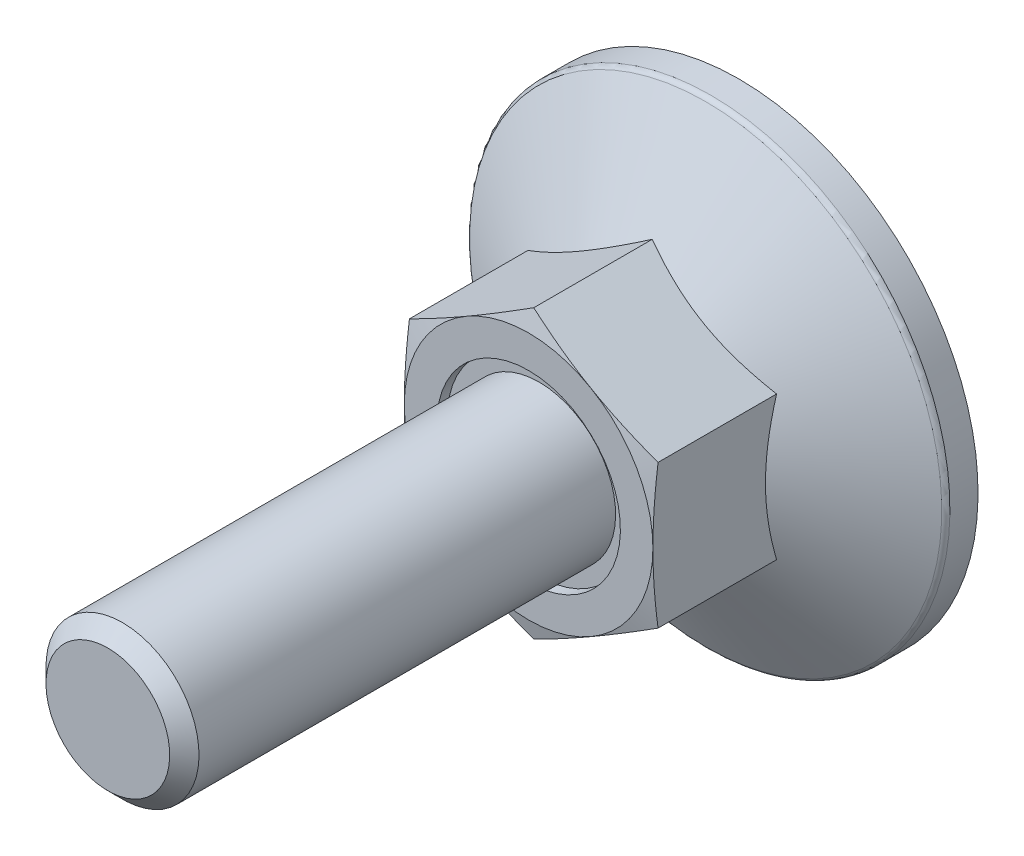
ISO-10303-21;
HEADER;
FILE_DESCRIPTION(('STEP AP214'),'2;1');
FILE_NAME('part.step','',(''),(''),'','','');
FILE_SCHEMA(('AUTOMOTIVE_DESIGN { 1 0 10303 214 1 1 1 1 }'));
ENDSEC;
DATA;
#1=APPLICATION_CONTEXT('core data for automotive mechanical design processes');
#2=APPLICATION_PROTOCOL_DEFINITION('international standard','automotive_design',2000,#1);
#3=PRODUCT_CONTEXT('',#1,'mechanical');
#4=PRODUCT('Part','Part','',(#3));
#5=PRODUCT_RELATED_PRODUCT_CATEGORY('part','',(#4));
#6=PRODUCT_DEFINITION_FORMATION('','',#4);
#7=PRODUCT_DEFINITION_CONTEXT('part definition',#1,'design');
#8=PRODUCT_DEFINITION('design','',#6,#7);
#9=PRODUCT_DEFINITION_SHAPE('','',#8);
#10=(LENGTH_UNIT() NAMED_UNIT(*) SI_UNIT(.MILLI.,.METRE.));
#11=(NAMED_UNIT(*) PLANE_ANGLE_UNIT() SI_UNIT($,.RADIAN.));
#12=(NAMED_UNIT(*) SI_UNIT($,.STERADIAN.) SOLID_ANGLE_UNIT());
#13=UNCERTAINTY_MEASURE_WITH_UNIT(LENGTH_MEASURE(1.E-05),#10,'distance_accuracy_value','');
#14=(GEOMETRIC_REPRESENTATION_CONTEXT(3) GLOBAL_UNCERTAINTY_ASSIGNED_CONTEXT((#13)) GLOBAL_UNIT_ASSIGNED_CONTEXT((#10,
#11,#12)) REPRESENTATION_CONTEXT('',''));
#15=CARTESIAN_POINT('',(0.,0.,0.));
#16=DIRECTION('',(0.,0.,1.));
#17=DIRECTION('',(1.,0.,0.));
#18=AXIS2_PLACEMENT_3D('',#15,#16,#17);
#19=CARTESIAN_POINT('',(0.,0.,10.45));
#20=DIRECTION('',(0.,0.,-1.));
#21=DIRECTION('',(0.,1.,0.));
#22=AXIS2_PLACEMENT_3D('',#19,#20,#21);
#23=PLANE('',#22);
#24=CARTESIAN_POINT('',(0.,0.,10.45));
#25=DIRECTION('',(0.,0.,-1.));
#26=DIRECTION('',(0.,1.,0.));
#27=AXIS2_PLACEMENT_3D('',#24,#25,#26);
#28=CIRCLE('',#27,4.8);
#29=CARTESIAN_POINT('',(0.,4.8,10.45));
#30=VERTEX_POINT('',#29);
#31=EDGE_CURVE('E27',#30,#30,#28,.T.);
#32=ORIENTED_EDGE('',*,*,#31,.F.);
#33=EDGE_LOOP('',(#32));
#34=FACE_BOUND('',#33,.T.);
#35=CARTESIAN_POINT('',(0.,0.,10.45));
#36=DIRECTION('',(0.,0.,-1.));
#37=DIRECTION('',(0.,1.,0.));
#38=AXIS2_PLACEMENT_3D('',#35,#36,#37);
#39=CIRCLE('',#38,4.);
#40=CARTESIAN_POINT('',(0.,4.,10.45));
#41=VERTEX_POINT('',#40);
#42=EDGE_CURVE('E252',#41,#41,#39,.F.);
#43=ORIENTED_EDGE('',*,*,#42,.F.);
#44=EDGE_LOOP('',(#43));
#45=FACE_BOUND('',#44,.T.);
#46=ADVANCED_FACE('F14',(#34,#45),#23,.F.);
#47=CARTESIAN_POINT('',(0.,7.5055534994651,22.));
#48=DIRECTION('',(0.499999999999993,-0.866025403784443,0.));
#49=DIRECTION('',(0.866025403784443,0.499999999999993,0.));
#50=AXIS2_PLACEMENT_3D('',#47,#48,#49);
#51=PLANE('',#50);
#52=CARTESIAN_POINT('',(-6.5002,3.75266127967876,4.53347836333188));
#53=CARTESIAN_POINT('',(-6.35732254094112,3.83515161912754,4.58109719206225));
#54=CARTESIAN_POINT('',(-6.21391236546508,3.91794952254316,4.62655491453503));
#55=CARTESIAN_POINT('',(-5.9259273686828,4.08421773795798,4.71255293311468));
#56=CARTESIAN_POINT('',(-5.78135207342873,4.16768832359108,4.7530911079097));
#57=CARTESIAN_POINT('',(-5.34531134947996,4.41943655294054,4.86653061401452));
#58=CARTESIAN_POINT('',(-5.05212471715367,4.58870793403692,4.93105380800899));
#59=CARTESIAN_POINT('',(-4.61337625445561,4.84201947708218,5.00671503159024));
#60=CARTESIAN_POINT('',(-4.46912536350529,4.92530276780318,5.02826875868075));
#61=CARTESIAN_POINT('',(-4.17997178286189,5.09224566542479,5.06441130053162));
#62=CARTESIAN_POINT('',(-4.03506915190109,5.17590523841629,5.07900073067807));
#63=CARTESIAN_POINT('',(-3.74501222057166,5.34336968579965,5.10084286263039));
#64=CARTESIAN_POINT('',(-3.59985839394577,5.42717428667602,5.10810389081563));
#65=CARTESIAN_POINT('',(-3.30942466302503,5.59485627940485,5.11514131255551));
#66=CARTESIAN_POINT('',(-3.16414476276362,5.67873366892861,5.11491793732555));
#67=CARTESIAN_POINT('',(-2.76612405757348,5.90853103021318,5.1040181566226));
#68=CARTESIAN_POINT('',(-2.51351353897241,6.05437578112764,5.08571979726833));
#69=CARTESIAN_POINT('',(-2.00997032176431,6.34509659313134,5.02769527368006));
#70=CARTESIAN_POINT('',(-1.75903939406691,6.48997163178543,4.9879492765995));
#71=CARTESIAN_POINT('',(-1.25448277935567,6.78127752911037,4.8885957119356));
#72=CARTESIAN_POINT('',(-1.00092075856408,6.92767163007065,4.82856718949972));
#73=CARTESIAN_POINT('',(-0.497578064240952,7.21827667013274,4.69232662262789));
#74=CARTESIAN_POINT('',(-0.247790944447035,7.36249133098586,4.61614658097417));
#75=CARTESIAN_POINT('',(0.000200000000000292,7.50566896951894,4.53347836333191));
#76=B_SPLINE_CURVE_WITH_KNOTS('',3,(#52,#53,#54,#55,#56,#57,#58,#59,#60,#61,#62,#63,#64,#65,#66,
#67,#68,#69,#70,#71,#72,#73,#74,#75),.UNSPECIFIED.,.F.,.F.,(4,2,2,2,2,2,2,2,2,2,2,4),(0.,
0.515105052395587,1.03043143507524,2.06322554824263,2.56697389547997,3.07067772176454,
3.57380860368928,4.07692394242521,4.95279354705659,5.82947446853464,6.72559912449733,
7.61996451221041),.UNSPECIFIED.);
#77=CARTESIAN_POINT('',(-6.5,3.7527767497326,4.53354503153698));
#78=VERTEX_POINT('',#77);
#79=CARTESIAN_POINT('',(0.,7.5055534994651,4.53354503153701));
#80=VERTEX_POINT('',#79);
#81=EDGE_CURVE('E100',#78,#80,#76,.T.);
#82=ORIENTED_EDGE('',*,*,#81,.F.);
#83=DIRECTION('',(0.,0.,-1.));
#84=VECTOR('',#83,1.);
#85=CARTESIAN_POINT('',(-6.5,3.7527767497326,22.));
#86=LINE('',#85,#84);
#87=CARTESIAN_POINT('',(-6.5,3.7527767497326,10.7305627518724));
#88=VERTEX_POINT('',#87);
#89=EDGE_CURVE('E91',#88,#78,#86,.T.);
#90=ORIENTED_EDGE('',*,*,#89,.F.);
#91=CARTESIAN_POINT('',(0.000200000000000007,7.50566896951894,10.7305318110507));
#92=CARTESIAN_POINT('',(-0.269745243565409,7.34981601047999,10.7723102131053));
#93=CARTESIAN_POINT('',(-0.540179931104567,7.19368047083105,10.8102381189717));
#94=CARTESIAN_POINT('',(-1.08200437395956,6.8808579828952,10.876873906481));
#95=CARTESIAN_POINT('',(-1.35339447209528,6.72417083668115,10.9055780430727));
#96=CARTESIAN_POINT('',(-1.89548428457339,6.41119513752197,10.952090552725));
#97=CARTESIAN_POINT('',(-2.16618033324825,6.25490870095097,10.9699543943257));
#98=CARTESIAN_POINT('',(-2.70791763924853,5.94213652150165,10.9939079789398));
#99=CARTESIAN_POINT('',(-2.97895881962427,5.78565082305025,11.));
#100=CARTESIAN_POINT('',(-3.52104118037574,5.47267942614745,11.));
#101=CARTESIAN_POINT('',(-3.79208236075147,5.31619372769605,10.9939079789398));
#102=CARTESIAN_POINT('',(-4.33381966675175,5.00342154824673,10.9699543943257));
#103=CARTESIAN_POINT('',(-4.60451571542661,4.84713511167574,10.952090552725));
#104=CARTESIAN_POINT('',(-5.14660552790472,4.53415941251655,10.9055780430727));
#105=CARTESIAN_POINT('',(-5.41799562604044,4.3774722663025,10.876873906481));
#106=CARTESIAN_POINT('',(-5.95982006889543,4.06464977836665,10.8102381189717));
#107=CARTESIAN_POINT('',(-6.23025475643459,3.90851423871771,10.7723102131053));
#108=CARTESIAN_POINT('',(-6.5002,3.75266127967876,10.7305318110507));
#109=B_SPLINE_CURVE_WITH_KNOTS('',3,(#91,#92,#93,#94,#95,#96,#97,#98,#99,#100,#101,#102,#103,
#104,#105,#106,#107,#108),.UNSPECIFIED.,.F.,.F.,(4,2,2,2,2,2,2,2,4),(0.,0.943529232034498,
1.88744107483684,2.82648138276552,3.76533995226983,4.70419852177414,5.64323882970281,
6.58715067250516,7.53067990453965),.UNSPECIFIED.);
#110=CARTESIAN_POINT('',(-3.24999999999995,5.62916512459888,11.));
#111=VERTEX_POINT('',#110);
#112=EDGE_CURVE('E191',#111,#88,#109,.T.);
#113=ORIENTED_EDGE('',*,*,#112,.F.);
#114=CARTESIAN_POINT('',(0.,7.5055534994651,10.7305627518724));
#115=VERTEX_POINT('',#114);
#116=EDGE_CURVE('E478',#115,#111,#109,.T.);
#117=ORIENTED_EDGE('',*,*,#116,.F.);
#118=DIRECTION('',(0.,0.,-1.));
#119=VECTOR('',#118,1.);
#120=CARTESIAN_POINT('',(0.,7.5055534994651,22.));
#121=LINE('',#120,#119);
#122=EDGE_CURVE('E104',#115,#80,#121,.T.);
#123=ORIENTED_EDGE('',*,*,#122,.T.);
#124=EDGE_LOOP('',(#82,#90,#113,#117,#123));
#125=FACE_BOUND('',#124,.T.);
#126=ADVANCED_FACE('F103',(#125),#51,.F.);
#127=CARTESIAN_POINT('',(6.5,3.7527767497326,22.));
#128=DIRECTION('',(-0.499999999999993,-0.866025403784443,0.));
#129=DIRECTION('',(0.866025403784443,-0.499999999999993,0.));
#130=AXIS2_PLACEMENT_3D('',#127,#128,#129);
#131=PLANE('',#130);
#132=CARTESIAN_POINT('',(-0.0002,7.50566896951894,4.53347836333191));
#133=CARTESIAN_POINT('',(0.142677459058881,7.42317863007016,4.58109719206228));
#134=CARTESIAN_POINT('',(0.286087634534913,7.34038072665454,4.62655491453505));
#135=CARTESIAN_POINT('',(0.574072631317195,7.17411251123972,4.71255293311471));
#136=CARTESIAN_POINT('',(0.718647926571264,7.09064192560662,4.75309110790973));
#137=CARTESIAN_POINT('',(1.15468865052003,6.83889369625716,4.86653061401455));
#138=CARTESIAN_POINT('',(1.44787528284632,6.66962231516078,4.93105380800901));
#139=CARTESIAN_POINT('',(1.88662374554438,6.41631077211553,5.00671503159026));
#140=CARTESIAN_POINT('',(2.03087463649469,6.33302748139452,5.02826875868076));
#141=CARTESIAN_POINT('',(2.32002821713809,6.16608458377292,5.06441130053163));
#142=CARTESIAN_POINT('',(2.46493084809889,6.08242501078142,5.07900073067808));
#143=CARTESIAN_POINT('',(2.75498777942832,5.91496056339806,5.10084286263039));
#144=CARTESIAN_POINT('',(2.90014160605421,5.8311559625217,5.10810389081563));
#145=CARTESIAN_POINT('',(3.19057533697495,5.66347396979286,5.11514131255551));
#146=CARTESIAN_POINT('',(3.33585523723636,5.5795965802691,5.11491793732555));
#147=CARTESIAN_POINT('',(3.73387594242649,5.34979921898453,5.10401815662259));
#148=CARTESIAN_POINT('',(3.98648646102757,5.20395446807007,5.08571979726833));
#149=CARTESIAN_POINT('',(4.49002967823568,4.91323365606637,5.02769527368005));
#150=CARTESIAN_POINT('',(4.74096060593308,4.76835861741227,4.98794927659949));
#151=CARTESIAN_POINT('',(5.24551722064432,4.47705272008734,4.88859571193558));
#152=CARTESIAN_POINT('',(5.49907924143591,4.33065861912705,4.8285671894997));
#153=CARTESIAN_POINT('',(6.00242193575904,4.04005357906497,4.69232662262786));
#154=CARTESIAN_POINT('',(6.25220905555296,3.89583891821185,4.61614658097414));
#155=CARTESIAN_POINT('',(6.5002,3.75266127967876,4.53347836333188));
#156=B_SPLINE_CURVE_WITH_KNOTS('',3,(#132,#133,#134,#135,#136,#137,#138,#139,#140,#141,#142,
#143,#144,#145,#146,#147,#148,#149,#150,#151,#152,#153,#154,#155),.UNSPECIFIED.,.F.,.F.,(4,2,2,
2,2,2,2,2,2,2,2,4),(0.,0.515105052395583,1.03043143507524,2.06322554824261,2.56697389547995,
3.07067772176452,3.57380860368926,4.07692394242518,4.95279354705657,5.82947446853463,
6.72559912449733,7.61996451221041),.UNSPECIFIED.);
#157=CARTESIAN_POINT('',(6.5,3.7527767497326,4.53354503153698));
#158=VERTEX_POINT('',#157);
#159=EDGE_CURVE('E34',#80,#158,#156,.T.);
#160=ORIENTED_EDGE('',*,*,#159,.F.);
#161=ORIENTED_EDGE('',*,*,#122,.F.);
#162=CARTESIAN_POINT('',(6.5002,3.75266127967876,10.7305318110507));
#163=CARTESIAN_POINT('',(6.23025475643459,3.90851423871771,10.7723102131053));
#164=CARTESIAN_POINT('',(5.95982006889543,4.06464977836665,10.8102381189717));
#165=CARTESIAN_POINT('',(5.41799562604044,4.37747226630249,10.876873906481));
#166=CARTESIAN_POINT('',(5.14660552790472,4.53415941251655,10.9055780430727));
#167=CARTESIAN_POINT('',(4.60451571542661,4.84713511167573,10.952090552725));
#168=CARTESIAN_POINT('',(4.33381966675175,5.00342154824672,10.9699543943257));
#169=CARTESIAN_POINT('',(3.79208236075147,5.31619372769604,10.9939079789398));
#170=CARTESIAN_POINT('',(3.52104118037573,5.47267942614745,11.));
#171=CARTESIAN_POINT('',(2.97895881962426,5.78565082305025,11.));
#172=CARTESIAN_POINT('',(2.70791763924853,5.94213652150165,10.9939079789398));
#173=CARTESIAN_POINT('',(2.16618033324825,6.25490870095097,10.9699543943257));
#174=CARTESIAN_POINT('',(1.89548428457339,6.41119513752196,10.952090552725));
#175=CARTESIAN_POINT('',(1.35339447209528,6.72417083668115,10.9055780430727));
#176=CARTESIAN_POINT('',(1.08200437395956,6.8808579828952,10.876873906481));
#177=CARTESIAN_POINT('',(0.540179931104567,7.19368047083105,10.8102381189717));
#178=CARTESIAN_POINT('',(0.26974524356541,7.34981601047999,10.7723102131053));
#179=CARTESIAN_POINT('',(-0.000199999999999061,7.50566896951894,10.7305318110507));
#180=B_SPLINE_CURVE_WITH_KNOTS('',3,(#162,#163,#164,#165,#166,#167,#168,#169,#170,#171,#172,
#173,#174,#175,#176,#177,#178,#179),.UNSPECIFIED.,.F.,.F.,(4,2,2,2,2,2,2,2,4),(0.,
0.943529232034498,1.88744107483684,2.82648138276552,3.76533995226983,4.70419852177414,
5.64323882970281,6.58715067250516,7.53067990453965),.UNSPECIFIED.);
#181=CARTESIAN_POINT('',(3.24999999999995,5.62916512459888,11.));
#182=VERTEX_POINT('',#181);
#183=EDGE_CURVE('E175',#182,#115,#180,.T.);
#184=ORIENTED_EDGE('',*,*,#183,.F.);
#185=CARTESIAN_POINT('',(6.5,3.7527767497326,10.7305627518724));
#186=VERTEX_POINT('',#185);
#187=EDGE_CURVE('E183',#186,#182,#180,.T.);
#188=ORIENTED_EDGE('',*,*,#187,.F.);
#189=DIRECTION('',(0.,0.,-1.));
#190=VECTOR('',#189,1.);
#191=CARTESIAN_POINT('',(6.5,3.7527767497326,22.));
#192=LINE('',#191,#190);
#193=EDGE_CURVE('E481',#186,#158,#192,.T.);
#194=ORIENTED_EDGE('',*,*,#193,.T.);
#195=EDGE_LOOP('',(#160,#161,#184,#188,#194));
#196=FACE_BOUND('',#195,.T.);
#197=ADVANCED_FACE('F165',(#196),#131,.F.);
#198=CARTESIAN_POINT('',(6.5,-3.7527767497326,22.));
#199=DIRECTION('',(-1.,0.,0.));
#200=DIRECTION('',(0.,-1.,0.));
#201=AXIS2_PLACEMENT_3D('',#198,#199,#200);
#202=PLANE('',#201);
#203=CARTESIAN_POINT('',(6.5,10.067414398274,1.94823609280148));
#204=CARTESIAN_POINT('',(6.5,9.78352438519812,2.0858958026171));
#205=CARTESIAN_POINT('',(6.5,9.49898106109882,2.22223138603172));
#206=CARTESIAN_POINT('',(6.5,8.9282401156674,2.49150895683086));
#207=CARTESIAN_POINT('',(6.5,8.64204224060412,2.62445040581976));
#208=CARTESIAN_POINT('',(6.5,8.06616487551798,2.88686541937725));
#209=CARTESIAN_POINT('',(6.5,7.77647490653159,3.01631606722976));
#210=CARTESIAN_POINT('',(6.5,7.19478507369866,3.26989907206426));
#211=CARTESIAN_POINT('',(6.5,6.90278532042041,3.3940316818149));
#212=CARTESIAN_POINT('',(6.5,6.30684739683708,3.6393457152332));
#213=CARTESIAN_POINT('',(6.5,6.00282105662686,3.76031411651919));
#214=CARTESIAN_POINT('',(6.5,5.39120706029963,3.99306391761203));
#215=CARTESIAN_POINT('',(6.5,5.08361900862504,4.10484428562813));
#216=CARTESIAN_POINT('',(6.5,4.46497231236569,4.31627594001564));
#217=CARTESIAN_POINT('',(6.5,4.15392216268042,4.41595183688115));
#218=CARTESIAN_POINT('',(6.5,3.52735818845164,4.59996747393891));
#219=CARTESIAN_POINT('',(6.5,3.21184580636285,4.6843120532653));
#220=CARTESIAN_POINT('',(6.5,2.57783458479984,4.83319256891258));
#221=CARTESIAN_POINT('',(6.5,2.25935972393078,4.8978289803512));
#222=CARTESIAN_POINT('',(6.5,1.61842059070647,5.00357646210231));
#223=CARTESIAN_POINT('',(6.5,1.29595672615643,5.04468991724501));
#224=CARTESIAN_POINT('',(6.5,0.812693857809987,5.08598811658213));
#225=CARTESIAN_POINT('',(6.5,0.652724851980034,5.09635596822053));
#226=CARTESIAN_POINT('',(6.5,0.332484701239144,5.110324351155));
#227=CARTESIAN_POINT('',(6.5,0.172213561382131,5.11392499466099));
#228=CARTESIAN_POINT('',(6.5,-0.148338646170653,5.11426557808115));
#229=CARTESIAN_POINT('',(6.5,-0.308619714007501,5.11100536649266));
#230=CARTESIAN_POINT('',(6.5,-0.628902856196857,5.09770543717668));
#231=CARTESIAN_POINT('',(6.5,-0.788904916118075,5.08766537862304));
#232=CARTESIAN_POINT('',(6.5,-1.1736673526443,5.05558094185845));
#233=CARTESIAN_POINT('',(6.5,-1.39816400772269,5.03030719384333));
#234=CARTESIAN_POINT('',(6.5,-1.84547349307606,4.96779217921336));
#235=CARTESIAN_POINT('',(6.5,-2.06828609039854,4.93054928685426));
#236=CARTESIAN_POINT('',(6.5,-2.73393776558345,4.80284369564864));
#237=CARTESIAN_POINT('',(6.5,-3.17375537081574,4.69642628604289));
#238=CARTESIAN_POINT('',(6.5,-3.83171733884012,4.51203063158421));
#239=CARTESIAN_POINT('',(6.5,-4.0532725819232,4.44552609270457));
#240=CARTESIAN_POINT('',(6.5,-4.49422901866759,4.30565892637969));
#241=CARTESIAN_POINT('',(6.5,-4.7136301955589,4.23229624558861));
#242=CARTESIAN_POINT('',(6.5,-5.15035386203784,4.07988627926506));
#243=CARTESIAN_POINT('',(6.5,-5.36767698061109,4.00084077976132));
#244=CARTESIAN_POINT('',(6.5,-5.800520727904,3.83799065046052));
#245=CARTESIAN_POINT('',(6.5,-6.01604140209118,3.75418614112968));
#246=CARTESIAN_POINT('',(6.5,-6.61842771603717,3.5135303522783));
#247=CARTESIAN_POINT('',(6.5,-7.00350435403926,3.35220459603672));
#248=CARTESIAN_POINT('',(6.5,-7.76959629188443,3.02014813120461));
#249=CARTESIAN_POINT('',(6.5,-8.15061109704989,2.84941629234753));
#250=CARTESIAN_POINT('',(6.5,-8.90957192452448,2.50088582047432));
#251=CARTESIAN_POINT('',(6.5,-9.28751663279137,2.32308433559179));
#252=CARTESIAN_POINT('',(6.5,-10.0408394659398,1.96218611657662));
#253=CARTESIAN_POINT('',(6.5,-10.4162177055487,1.77908962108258));
#254=CARTESIAN_POINT('',(6.5,-11.1655631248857,1.40849620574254));
#255=CARTESIAN_POINT('',(6.5,-11.5395269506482,1.22099251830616));
#256=CARTESIAN_POINT('',(6.5,-12.2858210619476,0.842758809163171));
#257=CARTESIAN_POINT('',(6.5,-12.6581513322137,0.652028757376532));
#258=CARTESIAN_POINT('',(6.5,-13.4013949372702,0.268043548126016));
#259=CARTESIAN_POINT('',(6.5,-13.7723085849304,0.0747889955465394));
#260=CARTESIAN_POINT('',(6.5,-14.5130449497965,-0.313800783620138));
#261=CARTESIAN_POINT('',(6.5,-14.8828676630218,-0.509136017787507));
#262=CARTESIAN_POINT('',(6.5,-15.9085714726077,-1.05391022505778));
#263=CARTESIAN_POINT('',(6.5,-16.5634819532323,-1.40517623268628));
#264=CARTESIAN_POINT('',(6.5,-17.871267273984,-2.11157255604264));
#265=CARTESIAN_POINT('',(6.5,-18.5241419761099,-2.46670312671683));
#266=CARTESIAN_POINT('',(6.5,-19.8261496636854,-3.17862531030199));
#267=CARTESIAN_POINT('',(6.5,-20.4752878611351,-3.53540739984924));
#268=CARTESIAN_POINT('',(6.5,-21.7722968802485,-4.25114422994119));
#269=CARTESIAN_POINT('',(6.5,-22.4201678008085,-4.61009879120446));
#270=CARTESIAN_POINT('',(6.5,-23.0675997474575,-4.9698379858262));
#271=B_SPLINE_CURVE_WITH_KNOTS('',3,(#203,#204,#205,#206,#207,#208,#209,#210,#211,#212,#213,
#214,#215,#216,#217,#218,#219,#220,#221,#222,#223,#224,#225,#226,#227,#228,#229,#230,#231,#232,
#233,#234,#235,#236,#237,#238,#239,#240,#241,#242,#243,#244,#245,#246,#247,#248,#249,#250,#251,
#252,#253,#254,#255,#256,#257,#258,#259,#260,#261,#262,#263,#264,#265,#266,#267,#268,#269,#270),
.UNSPECIFIED.,.F.,.F.,(4,2,2,2,2,2,2,2,2,2,2,2,2,2,2,2,2,2,2,2,2,2,2,2,2,2,2,2,2,2,2,2,2,4),(0.,
0.94652822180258,1.89320566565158,2.84505559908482,3.79686024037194,4.77837094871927,
5.75999172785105,6.73958204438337,7.71886262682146,8.69306383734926,9.66716626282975,
10.1479587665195,10.6287432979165,11.1095384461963,11.5903577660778,12.267719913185,
12.9451741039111,14.3007885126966,14.9946950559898,15.6886069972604,16.3823017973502,
17.0759790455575,18.3282990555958,19.5807698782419,20.8337511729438,22.086676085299,
23.3416700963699,24.5966758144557,25.8513861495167,27.1061010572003,29.3355785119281,
31.5652039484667,33.7873748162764,36.0093647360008),.UNSPECIFIED.);
#272=CARTESIAN_POINT('',(6.5,-3.7527767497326,4.53354503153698));
#273=VERTEX_POINT('',#272);
#274=EDGE_CURVE('E42',#158,#273,#271,.T.);
#275=ORIENTED_EDGE('',*,*,#274,.F.);
#276=ORIENTED_EDGE('',*,*,#193,.F.);
#277=CARTESIAN_POINT('',(6.5,9.92747995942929,9.56215186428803));
#278=CARTESIAN_POINT('',(6.5,9.63259364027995,9.62823955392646));
#279=CARTESIAN_POINT('',(6.5,9.33752287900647,9.69351898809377));
#280=CARTESIAN_POINT('',(6.5,8.74692189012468,9.82202506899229));
#281=CARTESIAN_POINT('',(6.5,8.45139164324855,9.88525162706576));
#282=CARTESIAN_POINT('',(6.5,7.85951636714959,10.0092707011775));
#283=CARTESIAN_POINT('',(6.5,7.56317082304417,10.0700607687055));
#284=CARTESIAN_POINT('',(6.5,6.9698629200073,10.1885506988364));
#285=CARTESIAN_POINT('',(6.5,6.67290056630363,10.2462505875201));
#286=CARTESIAN_POINT('',(6.5,6.08062010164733,10.3573796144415));
#287=CARTESIAN_POINT('',(6.5,5.78530770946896,10.410839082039));
#288=CARTESIAN_POINT('',(6.5,5.19387740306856,10.5130907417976));
#289=CARTESIAN_POINT('',(6.5,4.89775950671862,10.5618830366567));
#290=CARTESIAN_POINT('',(6.5,4.30466070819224,10.6537017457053));
#291=CARTESIAN_POINT('',(6.5,4.00767991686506,10.69672886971));
#292=CARTESIAN_POINT('',(6.5,3.41277328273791,10.7757492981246));
#293=CARTESIAN_POINT('',(6.5,3.11484743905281,10.8117425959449));
#294=CARTESIAN_POINT('',(6.5,2.51468954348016,10.8756761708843));
#295=CARTESIAN_POINT('',(6.5,2.21244707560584,10.9035201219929));
#296=CARTESIAN_POINT('',(6.5,1.60720229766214,10.9492341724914));
#297=CARTESIAN_POINT('',(6.5,1.30420000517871,10.9671045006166));
#298=CARTESIAN_POINT('',(6.5,0.697875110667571,10.9918290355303));
#299=CARTESIAN_POINT('',(6.5,0.394552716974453,10.9986882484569));
#300=CARTESIAN_POINT('',(6.5,-0.212135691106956,11.0009688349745));
#301=CARTESIAN_POINT('',(6.5,-0.515501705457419,10.9963902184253));
#302=CARTESIAN_POINT('',(6.5,-1.1229550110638,10.9760526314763));
#303=CARTESIAN_POINT('',(6.5,-1.42704091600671,10.9602530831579));
#304=CARTESIAN_POINT('',(6.5,-2.03449758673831,10.918375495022));
#305=CARTESIAN_POINT('',(6.5,-2.33786833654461,10.892297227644));
#306=CARTESIAN_POINT('',(6.5,-2.94389214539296,10.8311794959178));
#307=CARTESIAN_POINT('',(6.5,-3.24654460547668,10.7961341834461));
#308=CARTESIAN_POINT('',(6.5,-3.85087551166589,10.7185406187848));
#309=CARTESIAN_POINT('',(6.5,-4.15255395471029,10.6759923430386));
#310=CARTESIAN_POINT('',(6.5,-4.73502363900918,10.5877746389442));
#311=CARTESIAN_POINT('',(6.5,-5.01587505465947,10.5424985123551));
#312=CARTESIAN_POINT('',(6.5,-5.57683763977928,10.4475514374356));
#313=CARTESIAN_POINT('',(6.5,-5.85694878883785,10.3978803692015));
#314=CARTESIAN_POINT('',(6.5,-6.41653333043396,10.2949474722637));
#315=CARTESIAN_POINT('',(6.5,-6.69600666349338,10.2416853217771));
#316=CARTESIAN_POINT('',(6.5,-7.25437933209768,10.132225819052));
#317=CARTESIAN_POINT('',(6.5,-7.53327866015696,10.0760284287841));
#318=CARTESIAN_POINT('',(6.5,-8.36936246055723,9.90383082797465));
#319=CARTESIAN_POINT('',(6.5,-8.9258084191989,9.78424858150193));
#320=CARTESIAN_POINT('',(6.5,-10.0372205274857,9.53861051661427));
#321=CARTESIAN_POINT('',(6.5,-10.5921867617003,9.41255507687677));
#322=CARTESIAN_POINT('',(6.5,-11.6956125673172,9.15714489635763));
#323=CARTESIAN_POINT('',(6.5,-12.244082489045,9.02783474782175));
#324=CARTESIAN_POINT('',(6.5,-13.3402571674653,8.76597711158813));
#325=CARTESIAN_POINT('',(6.5,-13.8879619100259,8.6334295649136));
#326=CARTESIAN_POINT('',(6.5,-14.9821103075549,8.36610757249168));
#327=CARTESIAN_POINT('',(6.5,-15.528554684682,8.23133607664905));
#328=CARTESIAN_POINT('',(6.5,-16.6209674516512,7.95995280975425));
#329=CARTESIAN_POINT('',(6.5,-17.1669358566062,7.82334109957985));
#330=CARTESIAN_POINT('',(6.5,-17.7127383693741,7.6860776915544));
#331=B_SPLINE_CURVE_WITH_KNOTS('',3,(#277,#278,#279,#280,#281,#282,#283,#284,#285,#286,#287,
#288,#289,#290,#291,#292,#293,#294,#295,#296,#297,#298,#299,#300,#301,#302,#303,#304,#305,#306,
#307,#308,#309,#310,#311,#312,#313,#314,#315,#316,#317,#318,#319,#320,#321,#322,#323,#324,#325,
#326,#327,#328,#329,#330),.UNSPECIFIED.,.F.,.F.,(4,2,2,2,2,2,2,2,2,2,2,2,2,2,2,2,2,2,2,2,2,2,2,
2,2,2,4),(0.,0.906607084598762,1.8132532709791,2.72078883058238,3.62831672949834,
4.52862337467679,5.42891020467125,6.32908608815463,7.22926281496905,8.13968571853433,
9.05008774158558,9.96007573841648,10.8700629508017,11.7833577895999,12.6966728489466,
13.6105850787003,14.5245001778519,15.3778915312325,16.2313061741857,17.084797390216,
17.9382996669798,19.6456836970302,21.3529679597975,23.0434756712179,24.7340142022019,
26.4224665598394,28.1108631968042),.UNSPECIFIED.);
#332=CARTESIAN_POINT('',(6.5,0.,11.));
#333=VERTEX_POINT('',#332);
#334=EDGE_CURVE('E185',#333,#186,#331,.F.);
#335=ORIENTED_EDGE('',*,*,#334,.F.);
#336=CARTESIAN_POINT('',(6.5,-3.7527767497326,10.7305627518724));
#337=VERTEX_POINT('',#336);
#338=EDGE_CURVE('E184',#337,#333,#331,.F.);
#339=ORIENTED_EDGE('',*,*,#338,.F.);
#340=DIRECTION('',(0.,0.,-1.));
#341=VECTOR('',#340,1.);
#342=CARTESIAN_POINT('',(6.5,-3.7527767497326,22.));
#343=LINE('',#342,#341);
#344=EDGE_CURVE('E453',#337,#273,#343,.T.);
#345=ORIENTED_EDGE('',*,*,#344,.T.);
#346=EDGE_LOOP('',(#275,#276,#335,#339,#345));
#347=FACE_BOUND('',#346,.T.);
#348=ADVANCED_FACE('F169',(#347),#202,.F.);
#349=CARTESIAN_POINT('',(0.,-7.5055534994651,22.));
#350=DIRECTION('',(-0.499999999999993,0.866025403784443,0.));
#351=DIRECTION('',(-0.866025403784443,-0.499999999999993,0.));
#352=AXIS2_PLACEMENT_3D('',#349,#350,#351);
#353=PLANE('',#352);
#354=CARTESIAN_POINT('',(6.5002,-3.75266127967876,4.53347836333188));
#355=CARTESIAN_POINT('',(6.35732254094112,-3.83515161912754,4.58109719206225));
#356=CARTESIAN_POINT('',(6.21391236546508,-3.91794952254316,4.62655491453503));
#357=CARTESIAN_POINT('',(5.9259273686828,-4.08421773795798,4.71255293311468));
#358=CARTESIAN_POINT('',(5.78135207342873,-4.16768832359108,4.7530911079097));
#359=CARTESIAN_POINT('',(5.34531134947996,-4.41943655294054,4.86653061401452));
#360=CARTESIAN_POINT('',(5.05212471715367,-4.58870793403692,4.93105380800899));
#361=CARTESIAN_POINT('',(4.61337625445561,-4.84201947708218,5.00671503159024));
#362=CARTESIAN_POINT('',(4.46912536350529,-4.92530276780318,5.02826875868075));
#363=CARTESIAN_POINT('',(4.17997178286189,-5.09224566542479,5.06441130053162));
#364=CARTESIAN_POINT('',(4.03506915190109,-5.17590523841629,5.07900073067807));
#365=CARTESIAN_POINT('',(3.74501222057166,-5.34336968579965,5.10084286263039));
#366=CARTESIAN_POINT('',(3.59985839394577,-5.42717428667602,5.10810389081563));
#367=CARTESIAN_POINT('',(3.30942466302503,-5.59485627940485,5.11514131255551));
#368=CARTESIAN_POINT('',(3.16414476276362,-5.67873366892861,5.11491793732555));
#369=CARTESIAN_POINT('',(2.76612405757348,-5.90853103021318,5.1040181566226));
#370=CARTESIAN_POINT('',(2.51351353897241,-6.05437578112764,5.08571979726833));
#371=CARTESIAN_POINT('',(2.00997032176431,-6.34509659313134,5.02769527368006));
#372=CARTESIAN_POINT('',(1.75903939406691,-6.48997163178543,4.9879492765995));
#373=CARTESIAN_POINT('',(1.25448277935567,-6.78127752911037,4.8885957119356));
#374=CARTESIAN_POINT('',(1.00092075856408,-6.92767163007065,4.82856718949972));
#375=CARTESIAN_POINT('',(0.497578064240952,-7.21827667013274,4.69232662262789));
#376=CARTESIAN_POINT('',(0.247790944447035,-7.36249133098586,4.61614658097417));
#377=CARTESIAN_POINT('',(-0.000200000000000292,-7.50566896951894,4.53347836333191));
#378=B_SPLINE_CURVE_WITH_KNOTS('',3,(#354,#355,#356,#357,#358,#359,#360,#361,#362,#363,#364,
#365,#366,#367,#368,#369,#370,#371,#372,#373,#374,#375,#376,#377),.UNSPECIFIED.,.F.,.F.,(4,2,2,
2,2,2,2,2,2,2,2,4),(0.,0.515105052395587,1.03043143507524,2.06322554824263,2.56697389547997,
3.07067772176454,3.57380860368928,4.07692394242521,4.95279354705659,5.82947446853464,
6.72559912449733,7.61996451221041),.UNSPECIFIED.);
#379=CARTESIAN_POINT('',(0.,-7.5055534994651,4.53354503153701));
#380=VERTEX_POINT('',#379);
#381=EDGE_CURVE('E112',#273,#380,#378,.T.);
#382=ORIENTED_EDGE('',*,*,#381,.F.);
#383=ORIENTED_EDGE('',*,*,#344,.F.);
#384=CARTESIAN_POINT('',(-0.000200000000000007,-7.50566896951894,10.7305318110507));
#385=CARTESIAN_POINT('',(0.269745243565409,-7.34981601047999,10.7723102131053));
#386=CARTESIAN_POINT('',(0.540179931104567,-7.19368047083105,10.8102381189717));
#387=CARTESIAN_POINT('',(1.08200437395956,-6.8808579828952,10.876873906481));
#388=CARTESIAN_POINT('',(1.35339447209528,-6.72417083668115,10.9055780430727));
#389=CARTESIAN_POINT('',(1.89548428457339,-6.41119513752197,10.952090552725));
#390=CARTESIAN_POINT('',(2.16618033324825,-6.25490870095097,10.9699543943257));
#391=CARTESIAN_POINT('',(2.70791763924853,-5.94213652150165,10.9939079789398));
#392=CARTESIAN_POINT('',(2.97895881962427,-5.78565082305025,11.));
#393=CARTESIAN_POINT('',(3.52104118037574,-5.47267942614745,11.));
#394=CARTESIAN_POINT('',(3.79208236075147,-5.31619372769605,10.9939079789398));
#395=CARTESIAN_POINT('',(4.33381966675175,-5.00342154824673,10.9699543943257));
#396=CARTESIAN_POINT('',(4.60451571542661,-4.84713511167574,10.952090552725));
#397=CARTESIAN_POINT('',(5.14660552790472,-4.53415941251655,10.9055780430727));
#398=CARTESIAN_POINT('',(5.41799562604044,-4.3774722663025,10.876873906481));
#399=CARTESIAN_POINT('',(5.95982006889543,-4.06464977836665,10.8102381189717));
#400=CARTESIAN_POINT('',(6.23025475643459,-3.90851423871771,10.7723102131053));
#401=CARTESIAN_POINT('',(6.5002,-3.75266127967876,10.7305318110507));
#402=B_SPLINE_CURVE_WITH_KNOTS('',3,(#384,#385,#386,#387,#388,#389,#390,#391,#392,#393,#394,
#395,#396,#397,#398,#399,#400,#401),.UNSPECIFIED.,.F.,.F.,(4,2,2,2,2,2,2,2,4),(0.,
0.943529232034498,1.88744107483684,2.82648138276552,3.76533995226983,4.70419852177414,
5.64323882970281,6.58715067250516,7.53067990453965),.UNSPECIFIED.);
#403=CARTESIAN_POINT('',(3.24999999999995,-5.62916512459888,11.));
#404=VERTEX_POINT('',#403);
#405=EDGE_CURVE('E222',#404,#337,#402,.T.);
#406=ORIENTED_EDGE('',*,*,#405,.F.);
#407=CARTESIAN_POINT('',(0.,-7.5055534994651,10.7305627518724));
#408=VERTEX_POINT('',#407);
#409=EDGE_CURVE('E228',#408,#404,#402,.T.);
#410=ORIENTED_EDGE('',*,*,#409,.F.);
#411=DIRECTION('',(0.,0.,-1.));
#412=VECTOR('',#411,1.);
#413=CARTESIAN_POINT('',(0.,-7.5055534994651,22.));
#414=LINE('',#413,#412);
#415=EDGE_CURVE('E483',#408,#380,#414,.T.);
#416=ORIENTED_EDGE('',*,*,#415,.T.);
#417=EDGE_LOOP('',(#382,#383,#406,#410,#416));
#418=FACE_BOUND('',#417,.T.);
#419=ADVANCED_FACE('F230',(#418),#353,.F.);
#420=CARTESIAN_POINT('',(-6.5,-3.7527767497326,22.));
#421=DIRECTION('',(0.499999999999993,0.866025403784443,0.));
#422=DIRECTION('',(-0.866025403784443,0.499999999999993,0.));
#423=AXIS2_PLACEMENT_3D('',#420,#421,#422);
#424=PLANE('',#423);
#425=CARTESIAN_POINT('',(0.0002,-7.50566896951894,4.53347836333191));
#426=CARTESIAN_POINT('',(-0.142677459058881,-7.42317863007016,4.58109719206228));
#427=CARTESIAN_POINT('',(-0.286087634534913,-7.34038072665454,4.62655491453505));
#428=CARTESIAN_POINT('',(-0.574072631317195,-7.17411251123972,4.71255293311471));
#429=CARTESIAN_POINT('',(-0.718647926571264,-7.09064192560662,4.75309110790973));
#430=CARTESIAN_POINT('',(-1.15468865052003,-6.83889369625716,4.86653061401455));
#431=CARTESIAN_POINT('',(-1.44787528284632,-6.66962231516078,4.93105380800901));
#432=CARTESIAN_POINT('',(-1.88662374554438,-6.41631077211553,5.00671503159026));
#433=CARTESIAN_POINT('',(-2.03087463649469,-6.33302748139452,5.02826875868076));
#434=CARTESIAN_POINT('',(-2.32002821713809,-6.16608458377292,5.06441130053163));
#435=CARTESIAN_POINT('',(-2.46493084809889,-6.08242501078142,5.07900073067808));
#436=CARTESIAN_POINT('',(-2.75498777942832,-5.91496056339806,5.10084286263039));
#437=CARTESIAN_POINT('',(-2.90014160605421,-5.8311559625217,5.10810389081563));
#438=CARTESIAN_POINT('',(-3.19057533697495,-5.66347396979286,5.11514131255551));
#439=CARTESIAN_POINT('',(-3.33585523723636,-5.5795965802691,5.11491793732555));
#440=CARTESIAN_POINT('',(-3.73387594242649,-5.34979921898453,5.10401815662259));
#441=CARTESIAN_POINT('',(-3.98648646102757,-5.20395446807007,5.08571979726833));
#442=CARTESIAN_POINT('',(-4.49002967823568,-4.91323365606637,5.02769527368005));
#443=CARTESIAN_POINT('',(-4.74096060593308,-4.76835861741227,4.98794927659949));
#444=CARTESIAN_POINT('',(-5.24551722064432,-4.47705272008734,4.88859571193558));
#445=CARTESIAN_POINT('',(-5.49907924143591,-4.33065861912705,4.8285671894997));
#446=CARTESIAN_POINT('',(-6.00242193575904,-4.04005357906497,4.69232662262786));
#447=CARTESIAN_POINT('',(-6.25220905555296,-3.89583891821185,4.61614658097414));
#448=CARTESIAN_POINT('',(-6.5002,-3.75266127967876,4.53347836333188));
#449=B_SPLINE_CURVE_WITH_KNOTS('',3,(#425,#426,#427,#428,#429,#430,#431,#432,#433,#434,#435,
#436,#437,#438,#439,#440,#441,#442,#443,#444,#445,#446,#447,#448),.UNSPECIFIED.,.F.,.F.,(4,2,2,
2,2,2,2,2,2,2,2,4),(0.,0.515105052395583,1.03043143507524,2.06322554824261,2.56697389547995,
3.07067772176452,3.57380860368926,4.07692394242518,4.95279354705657,5.82947446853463,
6.72559912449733,7.61996451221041),.UNSPECIFIED.);
#450=CARTESIAN_POINT('',(-6.5,-3.7527767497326,4.53354503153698));
#451=VERTEX_POINT('',#450);
#452=EDGE_CURVE('E110',#380,#451,#449,.T.);
#453=ORIENTED_EDGE('',*,*,#452,.F.);
#454=ORIENTED_EDGE('',*,*,#415,.F.);
#455=CARTESIAN_POINT('',(-6.5002,-3.75266127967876,10.7305318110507));
#456=CARTESIAN_POINT('',(-6.23025475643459,-3.90851423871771,10.7723102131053));
#457=CARTESIAN_POINT('',(-5.95982006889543,-4.06464977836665,10.8102381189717));
#458=CARTESIAN_POINT('',(-5.41799562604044,-4.37747226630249,10.876873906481));
#459=CARTESIAN_POINT('',(-5.14660552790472,-4.53415941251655,10.9055780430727));
#460=CARTESIAN_POINT('',(-4.60451571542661,-4.84713511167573,10.952090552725));
#461=CARTESIAN_POINT('',(-4.33381966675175,-5.00342154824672,10.9699543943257));
#462=CARTESIAN_POINT('',(-3.79208236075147,-5.31619372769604,10.9939079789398));
#463=CARTESIAN_POINT('',(-3.52104118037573,-5.47267942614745,11.));
#464=CARTESIAN_POINT('',(-2.97895881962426,-5.78565082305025,11.));
#465=CARTESIAN_POINT('',(-2.70791763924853,-5.94213652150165,10.9939079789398));
#466=CARTESIAN_POINT('',(-2.16618033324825,-6.25490870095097,10.9699543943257));
#467=CARTESIAN_POINT('',(-1.89548428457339,-6.41119513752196,10.952090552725));
#468=CARTESIAN_POINT('',(-1.35339447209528,-6.72417083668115,10.9055780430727));
#469=CARTESIAN_POINT('',(-1.08200437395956,-6.8808579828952,10.876873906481));
#470=CARTESIAN_POINT('',(-0.540179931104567,-7.19368047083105,10.8102381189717));
#471=CARTESIAN_POINT('',(-0.26974524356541,-7.34981601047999,10.7723102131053));
#472=CARTESIAN_POINT('',(0.000199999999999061,-7.50566896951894,10.7305318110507));
#473=B_SPLINE_CURVE_WITH_KNOTS('',3,(#455,#456,#457,#458,#459,#460,#461,#462,#463,#464,#465,
#466,#467,#468,#469,#470,#471,#472),.UNSPECIFIED.,.F.,.F.,(4,2,2,2,2,2,2,2,4),(0.,
0.943529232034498,1.88744107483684,2.82648138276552,3.76533995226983,4.70419852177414,
5.64323882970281,6.58715067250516,7.53067990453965),.UNSPECIFIED.);
#474=CARTESIAN_POINT('',(-3.24999999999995,-5.62916512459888,11.));
#475=VERTEX_POINT('',#474);
#476=EDGE_CURVE('E216',#475,#408,#473,.T.);
#477=ORIENTED_EDGE('',*,*,#476,.F.);
#478=CARTESIAN_POINT('',(-6.5,-3.7527767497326,10.7305627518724));
#479=VERTEX_POINT('',#478);
#480=EDGE_CURVE('E229',#479,#475,#473,.T.);
#481=ORIENTED_EDGE('',*,*,#480,.F.);
#482=DIRECTION('',(0.,0.,-1.));
#483=VECTOR('',#482,1.);
#484=CARTESIAN_POINT('',(-6.5,-3.7527767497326,22.));
#485=LINE('',#484,#483);
#486=EDGE_CURVE('E99',#479,#451,#485,.T.);
#487=ORIENTED_EDGE('',*,*,#486,.T.);
#488=EDGE_LOOP('',(#453,#454,#477,#481,#487));
#489=FACE_BOUND('',#488,.T.);
#490=ADVANCED_FACE('F134',(#489),#424,.F.);
#491=CARTESIAN_POINT('',(-6.5,3.7527767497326,22.));
#492=DIRECTION('',(1.,0.,0.));
#493=DIRECTION('',(0.,1.,0.));
#494=AXIS2_PLACEMENT_3D('',#491,#492,#493);
#495=PLANE('',#494);
#496=CARTESIAN_POINT('',(-6.5,10.067414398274,1.94823609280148));
#497=CARTESIAN_POINT('',(-6.5,9.78352438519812,2.0858958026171));
#498=CARTESIAN_POINT('',(-6.5,9.49898106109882,2.22223138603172));
#499=CARTESIAN_POINT('',(-6.5,8.9282401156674,2.49150895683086));
#500=CARTESIAN_POINT('',(-6.5,8.64204224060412,2.62445040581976));
#501=CARTESIAN_POINT('',(-6.5,8.06616487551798,2.88686541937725));
#502=CARTESIAN_POINT('',(-6.5,7.77647490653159,3.01631606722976));
#503=CARTESIAN_POINT('',(-6.5,7.19478507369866,3.26989907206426));
#504=CARTESIAN_POINT('',(-6.5,6.90278532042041,3.3940316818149));
#505=CARTESIAN_POINT('',(-6.5,6.30684739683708,3.6393457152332));
#506=CARTESIAN_POINT('',(-6.5,6.00282105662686,3.76031411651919));
#507=CARTESIAN_POINT('',(-6.5,5.39120706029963,3.99306391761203));
#508=CARTESIAN_POINT('',(-6.5,5.08361900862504,4.10484428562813));
#509=CARTESIAN_POINT('',(-6.5,4.46497231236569,4.31627594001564));
#510=CARTESIAN_POINT('',(-6.5,4.15392216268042,4.41595183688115));
#511=CARTESIAN_POINT('',(-6.5,3.52735818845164,4.59996747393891));
#512=CARTESIAN_POINT('',(-6.5,3.21184580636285,4.6843120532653));
#513=CARTESIAN_POINT('',(-6.5,2.57783458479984,4.83319256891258));
#514=CARTESIAN_POINT('',(-6.5,2.25935972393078,4.8978289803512));
#515=CARTESIAN_POINT('',(-6.5,1.61842059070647,5.00357646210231));
#516=CARTESIAN_POINT('',(-6.5,1.29595672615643,5.04468991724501));
#517=CARTESIAN_POINT('',(-6.5,0.812693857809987,5.08598811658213));
#518=CARTESIAN_POINT('',(-6.5,0.652724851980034,5.09635596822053));
#519=CARTESIAN_POINT('',(-6.5,0.332484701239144,5.110324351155));
#520=CARTESIAN_POINT('',(-6.5,0.172213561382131,5.11392499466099));
#521=CARTESIAN_POINT('',(-6.5,-0.148338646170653,5.11426557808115));
#522=CARTESIAN_POINT('',(-6.5,-0.308619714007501,5.11100536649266));
#523=CARTESIAN_POINT('',(-6.5,-0.628902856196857,5.09770543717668));
#524=CARTESIAN_POINT('',(-6.5,-0.788904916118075,5.08766537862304));
#525=CARTESIAN_POINT('',(-6.5,-1.1736673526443,5.05558094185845));
#526=CARTESIAN_POINT('',(-6.5,-1.39816400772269,5.03030719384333));
#527=CARTESIAN_POINT('',(-6.5,-1.84547349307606,4.96779217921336));
#528=CARTESIAN_POINT('',(-6.5,-2.06828609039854,4.93054928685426));
#529=CARTESIAN_POINT('',(-6.5,-2.73393776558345,4.80284369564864));
#530=CARTESIAN_POINT('',(-6.5,-3.17375537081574,4.69642628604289));
#531=CARTESIAN_POINT('',(-6.5,-3.83171733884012,4.51203063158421));
#532=CARTESIAN_POINT('',(-6.5,-4.0532725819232,4.44552609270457));
#533=CARTESIAN_POINT('',(-6.5,-4.49422901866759,4.30565892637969));
#534=CARTESIAN_POINT('',(-6.5,-4.7136301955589,4.23229624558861));
#535=CARTESIAN_POINT('',(-6.5,-5.15035386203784,4.07988627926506));
#536=CARTESIAN_POINT('',(-6.5,-5.36767698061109,4.00084077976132));
#537=CARTESIAN_POINT('',(-6.5,-5.800520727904,3.83799065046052));
#538=CARTESIAN_POINT('',(-6.5,-6.01604140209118,3.75418614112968));
#539=CARTESIAN_POINT('',(-6.5,-6.61842771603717,3.5135303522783));
#540=CARTESIAN_POINT('',(-6.5,-7.00350435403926,3.35220459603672));
#541=CARTESIAN_POINT('',(-6.5,-7.76959629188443,3.02014813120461));
#542=CARTESIAN_POINT('',(-6.5,-8.15061109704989,2.84941629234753));
#543=CARTESIAN_POINT('',(-6.5,-8.90957192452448,2.50088582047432));
#544=CARTESIAN_POINT('',(-6.5,-9.28751663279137,2.32308433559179));
#545=CARTESIAN_POINT('',(-6.5,-10.0408394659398,1.96218611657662));
#546=CARTESIAN_POINT('',(-6.5,-10.4162177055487,1.77908962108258));
#547=CARTESIAN_POINT('',(-6.5,-11.1655631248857,1.40849620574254));
#548=CARTESIAN_POINT('',(-6.5,-11.5395269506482,1.22099251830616));
#549=CARTESIAN_POINT('',(-6.5,-12.2858210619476,0.842758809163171));
#550=CARTESIAN_POINT('',(-6.5,-12.6581513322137,0.652028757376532));
#551=CARTESIAN_POINT('',(-6.5,-13.4013949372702,0.268043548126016));
#552=CARTESIAN_POINT('',(-6.5,-13.7723085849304,0.0747889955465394));
#553=CARTESIAN_POINT('',(-6.5,-14.5130449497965,-0.313800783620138));
#554=CARTESIAN_POINT('',(-6.5,-14.8828676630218,-0.509136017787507));
#555=CARTESIAN_POINT('',(-6.5,-15.9085714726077,-1.05391022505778));
#556=CARTESIAN_POINT('',(-6.5,-16.5634819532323,-1.40517623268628));
#557=CARTESIAN_POINT('',(-6.5,-17.871267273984,-2.11157255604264));
#558=CARTESIAN_POINT('',(-6.5,-18.5241419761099,-2.46670312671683));
#559=CARTESIAN_POINT('',(-6.5,-19.8261496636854,-3.17862531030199));
#560=CARTESIAN_POINT('',(-6.5,-20.4752878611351,-3.53540739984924));
#561=CARTESIAN_POINT('',(-6.5,-21.7722968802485,-4.25114422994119));
#562=CARTESIAN_POINT('',(-6.5,-22.4201678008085,-4.61009879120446));
#563=CARTESIAN_POINT('',(-6.5,-23.0675997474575,-4.9698379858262));
#564=B_SPLINE_CURVE_WITH_KNOTS('',3,(#496,#497,#498,#499,#500,#501,#502,#503,#504,#505,#506,
#507,#508,#509,#510,#511,#512,#513,#514,#515,#516,#517,#518,#519,#520,#521,#522,#523,#524,#525,
#526,#527,#528,#529,#530,#531,#532,#533,#534,#535,#536,#537,#538,#539,#540,#541,#542,#543,#544,
#545,#546,#547,#548,#549,#550,#551,#552,#553,#554,#555,#556,#557,#558,#559,#560,#561,#562,#563),
.UNSPECIFIED.,.F.,.F.,(4,2,2,2,2,2,2,2,2,2,2,2,2,2,2,2,2,2,2,2,2,2,2,2,2,2,2,2,2,2,2,2,2,4),(0.,
0.94652822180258,1.89320566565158,2.84505559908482,3.79686024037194,4.77837094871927,
5.75999172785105,6.73958204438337,7.71886262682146,8.69306383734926,9.66716626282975,
10.1479587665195,10.6287432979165,11.1095384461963,11.5903577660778,12.267719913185,
12.9451741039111,14.3007885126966,14.9946950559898,15.6886069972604,16.3823017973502,
17.0759790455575,18.3282990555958,19.5807698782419,20.8337511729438,22.086676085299,
23.3416700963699,24.5966758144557,25.8513861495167,27.1061010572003,29.3355785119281,
31.5652039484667,33.7873748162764,36.0093647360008),.UNSPECIFIED.);
#565=EDGE_CURVE('E9',#451,#78,#564,.F.);
#566=ORIENTED_EDGE('',*,*,#565,.F.);
#567=ORIENTED_EDGE('',*,*,#486,.F.);
#568=CARTESIAN_POINT('',(-6.5,9.92747995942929,9.56215186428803));
#569=CARTESIAN_POINT('',(-6.5,9.63259364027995,9.62823955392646));
#570=CARTESIAN_POINT('',(-6.5,9.33752287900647,9.69351898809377));
#571=CARTESIAN_POINT('',(-6.5,8.74692189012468,9.82202506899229));
#572=CARTESIAN_POINT('',(-6.5,8.45139164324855,9.88525162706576));
#573=CARTESIAN_POINT('',(-6.5,7.85951636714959,10.0092707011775));
#574=CARTESIAN_POINT('',(-6.5,7.56317082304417,10.0700607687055));
#575=CARTESIAN_POINT('',(-6.5,6.9698629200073,10.1885506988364));
#576=CARTESIAN_POINT('',(-6.5,6.67290056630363,10.2462505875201));
#577=CARTESIAN_POINT('',(-6.5,6.08062010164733,10.3573796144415));
#578=CARTESIAN_POINT('',(-6.5,5.78530770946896,10.410839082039));
#579=CARTESIAN_POINT('',(-6.5,5.19387740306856,10.5130907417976));
#580=CARTESIAN_POINT('',(-6.5,4.89775950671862,10.5618830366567));
#581=CARTESIAN_POINT('',(-6.5,4.30466070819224,10.6537017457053));
#582=CARTESIAN_POINT('',(-6.5,4.00767991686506,10.69672886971));
#583=CARTESIAN_POINT('',(-6.5,3.41277328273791,10.7757492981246));
#584=CARTESIAN_POINT('',(-6.5,3.11484743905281,10.8117425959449));
#585=CARTESIAN_POINT('',(-6.5,2.51468954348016,10.8756761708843));
#586=CARTESIAN_POINT('',(-6.5,2.21244707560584,10.9035201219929));
#587=CARTESIAN_POINT('',(-6.5,1.60720229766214,10.9492341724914));
#588=CARTESIAN_POINT('',(-6.5,1.30420000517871,10.9671045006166));
#589=CARTESIAN_POINT('',(-6.5,0.697875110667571,10.9918290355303));
#590=CARTESIAN_POINT('',(-6.5,0.394552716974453,10.9986882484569));
#591=CARTESIAN_POINT('',(-6.5,-0.212135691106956,11.0009688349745));
#592=CARTESIAN_POINT('',(-6.5,-0.515501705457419,10.9963902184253));
#593=CARTESIAN_POINT('',(-6.5,-1.1229550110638,10.9760526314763));
#594=CARTESIAN_POINT('',(-6.5,-1.42704091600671,10.9602530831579));
#595=CARTESIAN_POINT('',(-6.5,-2.03449758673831,10.918375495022));
#596=CARTESIAN_POINT('',(-6.5,-2.33786833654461,10.892297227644));
#597=CARTESIAN_POINT('',(-6.5,-2.94389214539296,10.8311794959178));
#598=CARTESIAN_POINT('',(-6.5,-3.24654460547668,10.7961341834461));
#599=CARTESIAN_POINT('',(-6.5,-3.85087551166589,10.7185406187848));
#600=CARTESIAN_POINT('',(-6.5,-4.15255395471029,10.6759923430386));
#601=CARTESIAN_POINT('',(-6.5,-4.73502363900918,10.5877746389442));
#602=CARTESIAN_POINT('',(-6.5,-5.01587505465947,10.5424985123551));
#603=CARTESIAN_POINT('',(-6.5,-5.57683763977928,10.4475514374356));
#604=CARTESIAN_POINT('',(-6.5,-5.85694878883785,10.3978803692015));
#605=CARTESIAN_POINT('',(-6.5,-6.41653333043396,10.2949474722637));
#606=CARTESIAN_POINT('',(-6.5,-6.69600666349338,10.2416853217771));
#607=CARTESIAN_POINT('',(-6.5,-7.25437933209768,10.132225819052));
#608=CARTESIAN_POINT('',(-6.5,-7.53327866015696,10.0760284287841));
#609=CARTESIAN_POINT('',(-6.5,-8.36936246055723,9.90383082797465));
#610=CARTESIAN_POINT('',(-6.5,-8.9258084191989,9.78424858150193));
#611=CARTESIAN_POINT('',(-6.5,-10.0372205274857,9.53861051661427));
#612=CARTESIAN_POINT('',(-6.5,-10.5921867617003,9.41255507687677));
#613=CARTESIAN_POINT('',(-6.5,-11.6956125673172,9.15714489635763));
#614=CARTESIAN_POINT('',(-6.5,-12.244082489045,9.02783474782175));
#615=CARTESIAN_POINT('',(-6.5,-13.3402571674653,8.76597711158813));
#616=CARTESIAN_POINT('',(-6.5,-13.8879619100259,8.6334295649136));
#617=CARTESIAN_POINT('',(-6.5,-14.9821103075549,8.36610757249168));
#618=CARTESIAN_POINT('',(-6.5,-15.528554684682,8.23133607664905));
#619=CARTESIAN_POINT('',(-6.5,-16.6209674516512,7.95995280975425));
#620=CARTESIAN_POINT('',(-6.5,-17.1669358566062,7.82334109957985));
#621=CARTESIAN_POINT('',(-6.5,-17.7127383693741,7.6860776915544));
#622=B_SPLINE_CURVE_WITH_KNOTS('',3,(#568,#569,#570,#571,#572,#573,#574,#575,#576,#577,#578,
#579,#580,#581,#582,#583,#584,#585,#586,#587,#588,#589,#590,#591,#592,#593,#594,#595,#596,#597,
#598,#599,#600,#601,#602,#603,#604,#605,#606,#607,#608,#609,#610,#611,#612,#613,#614,#615,#616,
#617,#618,#619,#620,#621),.UNSPECIFIED.,.F.,.F.,(4,2,2,2,2,2,2,2,2,2,2,2,2,2,2,2,2,2,2,2,2,2,2,
2,2,2,4),(0.,0.906607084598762,1.8132532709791,2.72078883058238,3.62831672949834,
4.52862337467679,5.42891020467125,6.32908608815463,7.22926281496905,8.13968571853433,
9.05008774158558,9.96007573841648,10.8700629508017,11.7833577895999,12.6966728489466,
13.6105850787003,14.5245001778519,15.3778915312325,16.2313061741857,17.084797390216,
17.9382996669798,19.6456836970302,21.3529679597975,23.0434756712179,24.7340142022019,
26.4224665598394,28.1108631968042),.UNSPECIFIED.);
#623=CARTESIAN_POINT('',(-6.5,0.,11.));
#624=VERTEX_POINT('',#623);
#625=EDGE_CURVE('E207',#624,#479,#622,.T.);
#626=ORIENTED_EDGE('',*,*,#625,.F.);
#627=EDGE_CURVE('E96',#88,#624,#622,.T.);
#628=ORIENTED_EDGE('',*,*,#627,.F.);
#629=ORIENTED_EDGE('',*,*,#89,.T.);
#630=EDGE_LOOP('',(#566,#567,#626,#628,#629));
#631=FACE_BOUND('',#630,.T.);
#632=ADVANCED_FACE('F93',(#631),#495,.F.);
#633=CARTESIAN_POINT('',(0.,0.,11.));
#634=DIRECTION('',(0.,0.,-1.));
#635=DIRECTION('',(0.,1.,0.));
#636=AXIS2_PLACEMENT_3D('',#633,#634,#635);
#637=CONICAL_SURFACE('',#636,6.5,1.30899693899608);
#638=ORIENTED_EDGE('',*,*,#405,.T.);
#639=ORIENTED_EDGE('',*,*,#338,.T.);
#640=CARTESIAN_POINT('',(0.,0.,11.));
#641=DIRECTION('',(0.,0.,-1.));
#642=DIRECTION('',(0.,1.,0.));
#643=AXIS2_PLACEMENT_3D('',#640,#641,#642);
#644=CIRCLE('',#643,6.5);
#645=EDGE_CURVE('E450',#333,#404,#644,.T.);
#646=ORIENTED_EDGE('',*,*,#645,.T.);
#647=EDGE_LOOP('',(#638,#639,#646));
#648=FACE_BOUND('',#647,.T.);
#649=ADVANCED_FACE('F202',(#648),#637,.T.);
#650=EDGE_CURVE('E465',#182,#333,#644,.T.);
#651=ORIENTED_EDGE('',*,*,#650,.T.);
#652=ORIENTED_EDGE('',*,*,#334,.T.);
#653=ORIENTED_EDGE('',*,*,#187,.T.);
#654=EDGE_LOOP('',(#651,#652,#653));
#655=FACE_BOUND('',#654,.T.);
#656=ADVANCED_FACE('F377',(#655),#637,.T.);
#657=EDGE_CURVE('E474',#111,#182,#644,.T.);
#658=ORIENTED_EDGE('',*,*,#657,.T.);
#659=ORIENTED_EDGE('',*,*,#183,.T.);
#660=ORIENTED_EDGE('',*,*,#116,.T.);
#661=EDGE_LOOP('',(#658,#659,#660));
#662=FACE_BOUND('',#661,.T.);
#663=ADVANCED_FACE('F370',(#662),#637,.T.);
#664=ORIENTED_EDGE('',*,*,#476,.T.);
#665=ORIENTED_EDGE('',*,*,#409,.T.);
#666=EDGE_CURVE('E457',#404,#475,#644,.T.);
#667=ORIENTED_EDGE('',*,*,#666,.T.);
#668=EDGE_LOOP('',(#664,#665,#667));
#669=FACE_BOUND('',#668,.T.);
#670=ADVANCED_FACE('F363',(#669),#637,.T.);
#671=EDGE_CURVE('E466',#624,#111,#644,.T.);
#672=ORIENTED_EDGE('',*,*,#671,.T.);
#673=ORIENTED_EDGE('',*,*,#112,.T.);
#674=ORIENTED_EDGE('',*,*,#627,.T.);
#675=EDGE_LOOP('',(#672,#673,#674));
#676=FACE_BOUND('',#675,.T.);
#677=ADVANCED_FACE('F203',(#676),#637,.T.);
#678=CARTESIAN_POINT('',(0.,0.,0.));
#679=DIRECTION('',(0.,0.,-1.));
#680=DIRECTION('',(0.,1.,0.));
#681=AXIS2_PLACEMENT_3D('',#678,#679,#680);
#682=CYLINDRICAL_SURFACE('',#681,4.8);
#683=CARTESIAN_POINT('',(0.,0.,11.));
#684=DIRECTION('',(0.,0.,-1.));
#685=DIRECTION('',(0.,1.,0.));
#686=AXIS2_PLACEMENT_3D('',#683,#684,#685);
#687=CIRCLE('',#686,4.8);
#688=CARTESIAN_POINT('',(0.,4.8,11.));
#689=VERTEX_POINT('',#688);
#690=EDGE_CURVE('E464',#689,#689,#687,.T.);
#691=ORIENTED_EDGE('',*,*,#690,.F.);
#692=EDGE_LOOP('',(#691));
#693=FACE_BOUND('',#692,.T.);
#694=ORIENTED_EDGE('',*,*,#31,.T.);
#695=EDGE_LOOP('',(#694));
#696=FACE_BOUND('',#695,.T.);
#697=ADVANCED_FACE('F350',(#693,#696),#682,.F.);
#698=CARTESIAN_POINT('',(4.8,0.,11.));
#699=DIRECTION('',(0.,0.,-1.));
#700=DIRECTION('',(0.,1.,0.));
#701=AXIS2_PLACEMENT_3D('',#698,#699,#700);
#702=PLANE('',#701);
#703=ORIENTED_EDGE('',*,*,#645,.F.);
#704=ORIENTED_EDGE('',*,*,#650,.F.);
#705=ORIENTED_EDGE('',*,*,#657,.F.);
#706=ORIENTED_EDGE('',*,*,#671,.F.);
#707=EDGE_CURVE('E463',#475,#624,#644,.T.);
#708=ORIENTED_EDGE('',*,*,#707,.F.);
#709=ORIENTED_EDGE('',*,*,#666,.F.);
#710=EDGE_LOOP('',(#703,#704,#705,#706,#708,#709));
#711=FACE_BOUND('',#710,.T.);
#712=ORIENTED_EDGE('',*,*,#690,.T.);
#713=EDGE_LOOP('',(#712));
#714=FACE_BOUND('',#713,.T.);
#715=ADVANCED_FACE('F200',(#711,#714),#702,.F.);
#716=ORIENTED_EDGE('',*,*,#625,.T.);
#717=ORIENTED_EDGE('',*,*,#480,.T.);
#718=ORIENTED_EDGE('',*,*,#707,.T.);
#719=EDGE_LOOP('',(#716,#717,#718));
#720=FACE_BOUND('',#719,.T.);
#721=ADVANCED_FACE('F141',(#720),#637,.T.);
#722=CARTESIAN_POINT('',(0.,0.,8.8668783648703));
#723=DIRECTION('',(0.,0.,-1.));
#724=DIRECTION('',(0.,1.,0.));
#725=AXIS2_PLACEMENT_3D('',#722,#723,#724);
#726=CONICAL_SURFACE('',#725,0.,1.0471975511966);
#727=CARTESIAN_POINT('',(0.,0.,1.7402109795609));
#728=DIRECTION('',(0.,0.,-1.));
#729=DIRECTION('',(0.,1.,0.));
#730=AXIS2_PLACEMENT_3D('',#727,#728,#729);
#731=CIRCLE('',#730,12.34375);
#732=CARTESIAN_POINT('',(0.,12.34375,1.7402109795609));
#733=VERTEX_POINT('',#732);
#734=EDGE_CURVE('E116',#733,#733,#731,.T.);
#735=ORIENTED_EDGE('',*,*,#734,.F.);
#736=EDGE_LOOP('',(#735));
#737=FACE_BOUND('',#736,.T.);
#738=ORIENTED_EDGE('',*,*,#565,.T.);
#739=ORIENTED_EDGE('',*,*,#81,.T.);
#740=ORIENTED_EDGE('',*,*,#159,.T.);
#741=ORIENTED_EDGE('',*,*,#274,.T.);
#742=ORIENTED_EDGE('',*,*,#381,.T.);
#743=ORIENTED_EDGE('',*,*,#452,.T.);
#744=EDGE_LOOP('',(#738,#739,#740,#741,#742,#743));
#745=FACE_BOUND('',#744,.T.);
#746=ADVANCED_FACE('F108',(#737,#745),#726,.T.);
#747=CARTESIAN_POINT('',(0.,0.,1.46957804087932));
#748=DIRECTION('',(0.,0.,-1.));
#749=DIRECTION('',(0.,1.,0.));
#750=AXIS2_PLACEMENT_3D('',#747,#748,#749);
#751=TOROIDAL_SURFACE('',#750,12.1875000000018,0.312499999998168);
#752=ORIENTED_EDGE('',*,*,#734,.T.);
#753=EDGE_LOOP('',(#752));
#754=FACE_BOUND('',#753,.T.);
#755=CARTESIAN_POINT('',(0.,0.,1.46957804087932));
#756=DIRECTION('',(0.,0.,-1.));
#757=DIRECTION('',(0.,1.,0.));
#758=AXIS2_PLACEMENT_3D('',#755,#756,#757);
#759=CIRCLE('',#758,12.5);
#760=CARTESIAN_POINT('',(0.,12.5,1.46957804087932));
#761=VERTEX_POINT('',#760);
#762=EDGE_CURVE('E120',#761,#761,#759,.T.);
#763=ORIENTED_EDGE('',*,*,#762,.F.);
#764=EDGE_LOOP('',(#763));
#765=FACE_BOUND('',#764,.T.);
#766=ADVANCED_FACE('F140',(#754,#765),#751,.T.);
#767=CARTESIAN_POINT('',(0.,0.,0.));
#768=DIRECTION('',(0.,0.,-1.));
#769=DIRECTION('',(0.,1.,0.));
#770=AXIS2_PLACEMENT_3D('',#767,#768,#769);
#771=CYLINDRICAL_SURFACE('',#770,12.5);
#772=CARTESIAN_POINT('',(0.,0.,0.));
#773=DIRECTION('',(0.,0.,-1.));
#774=DIRECTION('',(0.,1.,0.));
#775=AXIS2_PLACEMENT_3D('',#772,#773,#774);
#776=CIRCLE('',#775,12.5);
#777=CARTESIAN_POINT('',(0.,12.5,0.));
#778=VERTEX_POINT('',#777);
#779=EDGE_CURVE('E254',#778,#778,#776,.T.);
#780=ORIENTED_EDGE('',*,*,#779,.F.);
#781=EDGE_LOOP('',(#780));
#782=FACE_BOUND('',#781,.T.);
#783=ORIENTED_EDGE('',*,*,#762,.T.);
#784=EDGE_LOOP('',(#783));
#785=FACE_BOUND('',#784,.T.);
#786=ADVANCED_FACE('F266',(#782,#785),#771,.T.);
#787=CARTESIAN_POINT('',(7.8,0.,0.));
#788=DIRECTION('',(0.,0.,1.));
#789=DIRECTION('',(0.,-1.,0.));
#790=AXIS2_PLACEMENT_3D('',#787,#788,#789);
#791=PLANE('',#790);
#792=ORIENTED_EDGE('',*,*,#779,.T.);
#793=EDGE_LOOP('',(#792));
#794=FACE_BOUND('',#793,.T.);
#795=ADVANCED_FACE('F171',(#794),#791,.F.);
#796=CARTESIAN_POINT('',(0.,0.,0.));
#797=DIRECTION('',(0.,0.,-1.));
#798=DIRECTION('',(0.,1.,0.));
#799=AXIS2_PLACEMENT_3D('',#796,#797,#798);
#800=CYLINDRICAL_SURFACE('',#799,4.);
#801=ORIENTED_EDGE('',*,*,#42,.T.);
#802=EDGE_LOOP('',(#801));
#803=FACE_BOUND('',#802,.T.);
#804=CARTESIAN_POINT('',(0.,0.,32.233));
#805=DIRECTION('',(0.,0.,-1.));
#806=DIRECTION('',(0.,1.,0.));
#807=AXIS2_PLACEMENT_3D('',#804,#805,#806);
#808=CIRCLE('',#807,4.);
#809=CARTESIAN_POINT('',(0.,4.,32.233));
#810=VERTEX_POINT('',#809);
#811=EDGE_CURVE('E260',#810,#810,#808,.T.);
#812=ORIENTED_EDGE('',*,*,#811,.T.);
#813=EDGE_LOOP('',(#812));
#814=FACE_BOUND('',#813,.T.);
#815=ADVANCED_FACE('F280',(#803,#814),#800,.T.);
#816=CARTESIAN_POINT('',(0.,0.,33.));
#817=DIRECTION('',(0.,0.,-1.));
#818=DIRECTION('',(0.,1.,0.));
#819=AXIS2_PLACEMENT_3D('',#816,#817,#818);
#820=PLANE('',#819);
#821=CARTESIAN_POINT('',(0.,0.,33.));
#822=DIRECTION('',(0.,0.,-1.));
#823=DIRECTION('',(0.,1.,0.));
#824=AXIS2_PLACEMENT_3D('',#821,#822,#823);
#825=CIRCLE('',#824,3.233);
#826=CARTESIAN_POINT('',(0.,3.233,33.));
#827=VERTEX_POINT('',#826);
#828=EDGE_CURVE('E255',#827,#827,#825,.T.);
#829=ORIENTED_EDGE('',*,*,#828,.F.);
#830=EDGE_LOOP('',(#829));
#831=FACE_BOUND('',#830,.T.);
#832=ADVANCED_FACE('F284',(#831),#820,.F.);
#833=CARTESIAN_POINT('',(0.,0.,33.));
#834=DIRECTION('',(0.,0.,-1.));
#835=DIRECTION('',(0.,1.,0.));
#836=AXIS2_PLACEMENT_3D('',#833,#834,#835);
#837=CONICAL_SURFACE('',#836,3.233,0.785398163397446);
#838=ORIENTED_EDGE('',*,*,#811,.F.);
#839=EDGE_LOOP('',(#838));
#840=FACE_BOUND('',#839,.T.);
#841=ORIENTED_EDGE('',*,*,#828,.T.);
#842=EDGE_LOOP('',(#841));
#843=FACE_BOUND('',#842,.T.);
#844=ADVANCED_FACE('F287',(#840,#843),#837,.T.);
#845=CLOSED_SHELL('',(#46,#126,#197,#348,#419,#490,#632,#649,#656,#663,#670,#677,#697,#715,#721,
#746,#766,#786,#795,#815,#832,#844));
#846=MANIFOLD_SOLID_BREP('B1',#845);
#847=ADVANCED_BREP_SHAPE_REPRESENTATION('',(#18,#846),#14);
#848=SHAPE_DEFINITION_REPRESENTATION(#9,#847);
ENDSEC;
END-ISO-10303-21;
